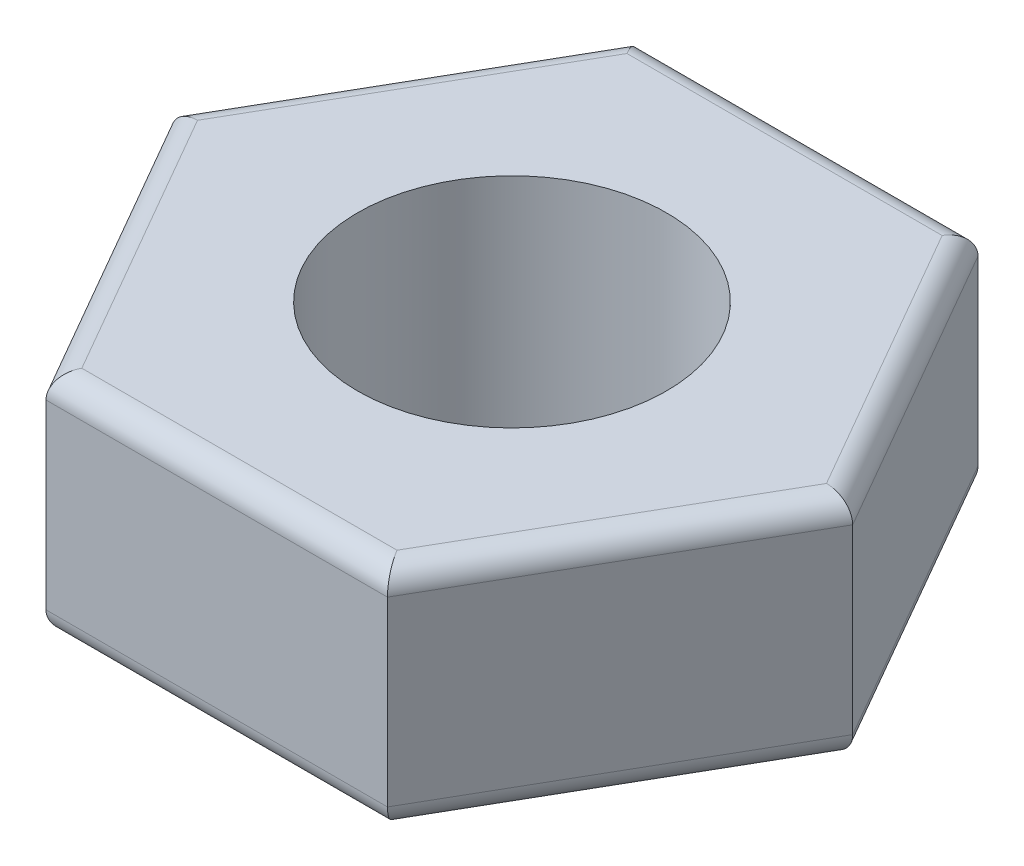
ISO-10303-21;
HEADER;
FILE_DESCRIPTION(('STEP AP214'),'2;1');
FILE_NAME('part.step','',(''),(''),'','','');
FILE_SCHEMA(('AUTOMOTIVE_DESIGN { 1 0 10303 214 1 1 1 1 }'));
ENDSEC;
DATA;
#1=APPLICATION_CONTEXT('core data for automotive mechanical design processes');
#2=APPLICATION_PROTOCOL_DEFINITION('international standard','automotive_design',2000,#1);
#3=PRODUCT_CONTEXT('',#1,'mechanical');
#4=PRODUCT('Part','Part','',(#3));
#5=PRODUCT_RELATED_PRODUCT_CATEGORY('part','',(#4));
#6=PRODUCT_DEFINITION_FORMATION('','',#4);
#7=PRODUCT_DEFINITION_CONTEXT('part definition',#1,'design');
#8=PRODUCT_DEFINITION('design','',#6,#7);
#9=PRODUCT_DEFINITION_SHAPE('','',#8);
#10=(LENGTH_UNIT() NAMED_UNIT(*) SI_UNIT(.MILLI.,.METRE.));
#11=(NAMED_UNIT(*) PLANE_ANGLE_UNIT() SI_UNIT($,.RADIAN.));
#12=(NAMED_UNIT(*) SI_UNIT($,.STERADIAN.) SOLID_ANGLE_UNIT());
#13=UNCERTAINTY_MEASURE_WITH_UNIT(LENGTH_MEASURE(1.E-05),#10,'distance_accuracy_value','');
#14=(GEOMETRIC_REPRESENTATION_CONTEXT(3) GLOBAL_UNCERTAINTY_ASSIGNED_CONTEXT((#13)) GLOBAL_UNIT_ASSIGNED_CONTEXT((#10,
#11,#12)) REPRESENTATION_CONTEXT('',''));
#15=CARTESIAN_POINT('',(0.,0.,0.));
#16=DIRECTION('',(0.,0.,1.));
#17=DIRECTION('',(1.,0.,0.));
#18=AXIS2_PLACEMENT_3D('',#15,#16,#17);
#19=CARTESIAN_POINT('',(3.75834261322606,5.,6.5));
#20=DIRECTION('',(0.,1.,0.));
#21=DIRECTION('',(0.,0.,1.));
#22=AXIS2_PLACEMENT_3D('',#19,#20,#21);
#23=PLANE('',#22);
#24=DIRECTION('',(-0.498887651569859,0.,0.866666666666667));
#25=VECTOR('',#24,1.);
#26=CARTESIAN_POINT('',(-7.06666666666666,5.,0.249443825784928));
#27=LINE('',#26,#25);
#28=CARTESIAN_POINT('',(-3.46923933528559,5.,-6.));
#29=VERTEX_POINT('',#28);
#30=CARTESIAN_POINT('',(-6.92307692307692,5.,0.));
#31=VERTEX_POINT('',#30);
#32=EDGE_CURVE('E38',#29,#31,#27,.T.);
#33=ORIENTED_EDGE('',*,*,#32,.T.);
#34=DIRECTION('',(0.498887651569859,0.,0.866666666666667));
#35=VECTOR('',#34,1.);
#36=CARTESIAN_POINT('',(-3.32500927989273,5.,6.25055617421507));
#37=LINE('',#36,#35);
#38=CARTESIAN_POINT('',(-3.46923933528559,5.,6.));
#39=VERTEX_POINT('',#38);
#40=EDGE_CURVE('E11',#31,#39,#37,.T.);
#41=ORIENTED_EDGE('',*,*,#40,.T.);
#42=DIRECTION('',(1.,0.,0.));
#43=VECTOR('',#42,1.);
#44=CARTESIAN_POINT('',(3.75834261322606,5.,6.));
#45=LINE('',#44,#43);
#46=CARTESIAN_POINT('',(3.46923933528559,5.,6.));
#47=VERTEX_POINT('',#46);
#48=EDGE_CURVE('E152',#39,#47,#45,.T.);
#49=ORIENTED_EDGE('',*,*,#48,.T.);
#50=DIRECTION('',(0.498887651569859,0.,-0.866666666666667));
#51=VECTOR('',#50,1.);
#52=CARTESIAN_POINT('',(7.06666666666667,5.,-0.249443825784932));
#53=LINE('',#52,#51);
#54=CARTESIAN_POINT('',(6.92307692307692,5.,0.));
#55=VERTEX_POINT('',#54);
#56=EDGE_CURVE('E230',#47,#55,#53,.T.);
#57=ORIENTED_EDGE('',*,*,#56,.T.);
#58=DIRECTION('',(-0.498887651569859,0.,-0.866666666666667));
#59=VECTOR('',#58,1.);
#60=CARTESIAN_POINT('',(3.32500927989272,5.,-6.25055617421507));
#61=LINE('',#60,#59);
#62=CARTESIAN_POINT('',(3.46923933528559,5.,-6.));
#63=VERTEX_POINT('',#62);
#64=EDGE_CURVE('E232',#55,#63,#61,.T.);
#65=ORIENTED_EDGE('',*,*,#64,.T.);
#66=DIRECTION('',(-1.,0.,0.));
#67=VECTOR('',#66,1.);
#68=CARTESIAN_POINT('',(-3.75834261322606,5.,-6.));
#69=LINE('',#68,#67);
#70=EDGE_CURVE('E48',#63,#29,#69,.T.);
#71=ORIENTED_EDGE('',*,*,#70,.T.);
#72=EDGE_LOOP('',(#33,#41,#49,#57,#65,#71));
#73=FACE_BOUND('',#72,.T.);
#74=CARTESIAN_POINT('',(0.,5.,0.));
#75=DIRECTION('',(0.,1.,0.));
#76=DIRECTION('',(0.,0.,1.));
#77=AXIS2_PLACEMENT_3D('',#74,#75,#76);
#78=CIRCLE('',#77,3.4);
#79=CARTESIAN_POINT('',(0.,5.,3.4));
#80=VERTEX_POINT('',#79);
#81=EDGE_CURVE('E141',#80,#80,#78,.T.);
#82=ORIENTED_EDGE('',*,*,#81,.F.);
#83=EDGE_LOOP('',(#82));
#84=FACE_BOUND('',#83,.T.);
#85=ADVANCED_FACE('F30',(#73,#84),#23,.T.);
#86=CARTESIAN_POINT('',(3.75834261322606,0.,6.5));
#87=DIRECTION('',(0.,1.,0.));
#88=DIRECTION('',(0.,0.,1.));
#89=AXIS2_PLACEMENT_3D('',#86,#87,#88);
#90=PLANE('',#89);
#91=DIRECTION('',(1.,0.,0.));
#92=VECTOR('',#91,1.);
#93=CARTESIAN_POINT('',(3.75834261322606,0.,6.));
#94=LINE('',#93,#92);
#95=CARTESIAN_POINT('',(3.46923933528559,0.,6.));
#96=VERTEX_POINT('',#95);
#97=CARTESIAN_POINT('',(-3.46923933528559,0.,6.));
#98=VERTEX_POINT('',#97);
#99=EDGE_CURVE('E200',#96,#98,#94,.F.);
#100=ORIENTED_EDGE('',*,*,#99,.T.);
#101=DIRECTION('',(0.498887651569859,0.,0.866666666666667));
#102=VECTOR('',#101,1.);
#103=CARTESIAN_POINT('',(-1.45418984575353,0.,9.50054008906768));
#104=LINE('',#103,#102);
#105=CARTESIAN_POINT('',(-6.92307692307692,0.,0.));
#106=VERTEX_POINT('',#105);
#107=EDGE_CURVE('E210',#98,#106,#104,.F.);
#108=ORIENTED_EDGE('',*,*,#107,.T.);
#109=DIRECTION('',(-0.498887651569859,0.,0.866666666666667));
#110=VECTOR('',#109,1.);
#111=CARTESIAN_POINT('',(-7.07499072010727,0.,0.263904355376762));
#112=LINE('',#111,#110);
#113=CARTESIAN_POINT('',(-3.46923933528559,0.,-6.));
#114=VERTEX_POINT('',#113);
#115=EDGE_CURVE('E208',#106,#114,#112,.F.);
#116=ORIENTED_EDGE('',*,*,#115,.T.);
#117=DIRECTION('',(-1.,0.,0.));
#118=VECTOR('',#117,1.);
#119=CARTESIAN_POINT('',(3.75834261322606,0.,-6.));
#120=LINE('',#119,#118);
#121=CARTESIAN_POINT('',(3.46923933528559,0.,-6.));
#122=VERTEX_POINT('',#121);
#123=EDGE_CURVE('E206',#114,#122,#120,.F.);
#124=ORIENTED_EDGE('',*,*,#123,.T.);
#125=DIRECTION('',(-0.498887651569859,0.,-0.866666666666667));
#126=VECTOR('',#125,1.);
#127=CARTESIAN_POINT('',(8.94581015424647,0.,3.51388827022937));
#128=LINE('',#127,#126);
#129=CARTESIAN_POINT('',(6.92307692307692,0.,0.));
#130=VERTEX_POINT('',#129);
#131=EDGE_CURVE('E204',#122,#130,#128,.F.);
#132=ORIENTED_EDGE('',*,*,#131,.T.);
#133=DIRECTION('',(0.498887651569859,0.,-0.866666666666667));
#134=VECTOR('',#133,1.);
#135=CARTESIAN_POINT('',(3.32500927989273,0.,6.25055617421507));
#136=LINE('',#135,#134);
#137=EDGE_CURVE('E202',#130,#96,#136,.F.);
#138=ORIENTED_EDGE('',*,*,#137,.T.);
#139=EDGE_LOOP('',(#100,#108,#116,#124,#132,#138));
#140=FACE_BOUND('',#139,.T.);
#141=CARTESIAN_POINT('',(0.,0.,0.));
#142=DIRECTION('',(0.,1.,0.));
#143=DIRECTION('',(0.,0.,1.));
#144=AXIS2_PLACEMENT_3D('',#141,#142,#143);
#145=CIRCLE('',#144,3.4);
#146=CARTESIAN_POINT('',(0.,0.,3.4));
#147=VERTEX_POINT('',#146);
#148=EDGE_CURVE('E183',#147,#147,#145,.T.);
#149=ORIENTED_EDGE('',*,*,#148,.T.);
#150=EDGE_LOOP('',(#149));
#151=FACE_BOUND('',#150,.T.);
#152=ADVANCED_FACE('F270',(#140,#151),#90,.F.);
#153=CARTESIAN_POINT('',(-3.75834261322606,5.,6.5));
#154=DIRECTION('',(0.,0.,-1.));
#155=DIRECTION('',(-1.,0.,0.));
#156=AXIS2_PLACEMENT_3D('',#153,#154,#155);
#157=PLANE('',#156);
#158=DIRECTION('',(0.,-1.,0.));
#159=VECTOR('',#158,1.);
#160=CARTESIAN_POINT('',(-3.75834261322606,5.,6.5));
#161=LINE('',#160,#159);
#162=CARTESIAN_POINT('',(-3.75834261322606,4.5,6.5));
#163=VERTEX_POINT('',#162);
#164=CARTESIAN_POINT('',(-3.75834261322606,0.5,6.5));
#165=VERTEX_POINT('',#164);
#166=EDGE_CURVE('E120',#163,#165,#161,.T.);
#167=ORIENTED_EDGE('',*,*,#166,.T.);
#168=DIRECTION('',(1.,0.,0.));
#169=VECTOR('',#168,1.);
#170=CARTESIAN_POINT('',(-3.75834261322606,0.5,6.5));
#171=LINE('',#170,#169);
#172=CARTESIAN_POINT('',(3.75834261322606,0.5,6.5));
#173=VERTEX_POINT('',#172);
#174=EDGE_CURVE('E127',#165,#173,#171,.T.);
#175=ORIENTED_EDGE('',*,*,#174,.T.);
#176=DIRECTION('',(0.,-1.,0.));
#177=VECTOR('',#176,1.);
#178=CARTESIAN_POINT('',(3.75834261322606,5.,6.5));
#179=LINE('',#178,#177);
#180=CARTESIAN_POINT('',(3.75834261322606,4.5,6.5));
#181=VERTEX_POINT('',#180);
#182=EDGE_CURVE('E122',#181,#173,#179,.T.);
#183=ORIENTED_EDGE('',*,*,#182,.F.);
#184=DIRECTION('',(1.,0.,0.));
#185=VECTOR('',#184,1.);
#186=CARTESIAN_POINT('',(-3.75834261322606,4.5,6.5));
#187=LINE('',#186,#185);
#188=EDGE_CURVE('E118',#181,#163,#187,.F.);
#189=ORIENTED_EDGE('',*,*,#188,.T.);
#190=EDGE_LOOP('',(#167,#175,#183,#189));
#191=FACE_BOUND('',#190,.T.);
#192=ADVANCED_FACE('F32',(#191),#157,.F.);
#193=CARTESIAN_POINT('',(3.75834261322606,5.,6.5));
#194=DIRECTION('',(-0.866666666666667,0.,-0.498887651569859));
#195=DIRECTION('',(-0.498887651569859,0.,0.866666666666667));
#196=AXIS2_PLACEMENT_3D('',#193,#194,#195);
#197=PLANE('',#196);
#198=ORIENTED_EDGE('',*,*,#182,.T.);
#199=DIRECTION('',(0.498887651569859,0.,-0.866666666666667));
#200=VECTOR('',#199,1.);
#201=CARTESIAN_POINT('',(3.75834261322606,0.5,6.5));
#202=LINE('',#201,#200);
#203=CARTESIAN_POINT('',(7.5,0.5,0.));
#204=VERTEX_POINT('',#203);
#205=EDGE_CURVE('E128',#173,#204,#202,.T.);
#206=ORIENTED_EDGE('',*,*,#205,.T.);
#207=DIRECTION('',(0.,-1.,0.));
#208=VECTOR('',#207,1.);
#209=CARTESIAN_POINT('',(7.5,5.,0.));
#210=LINE('',#209,#208);
#211=CARTESIAN_POINT('',(7.5,4.5,0.));
#212=VERTEX_POINT('',#211);
#213=EDGE_CURVE('E195',#212,#204,#210,.T.);
#214=ORIENTED_EDGE('',*,*,#213,.F.);
#215=DIRECTION('',(0.498887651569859,0.,-0.866666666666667));
#216=VECTOR('',#215,1.);
#217=CARTESIAN_POINT('',(3.75834261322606,4.5,6.5));
#218=LINE('',#217,#216);
#219=EDGE_CURVE('E225',#212,#181,#218,.F.);
#220=ORIENTED_EDGE('',*,*,#219,.T.);
#221=EDGE_LOOP('',(#198,#206,#214,#220));
#222=FACE_BOUND('',#221,.T.);
#223=ADVANCED_FACE('F252',(#222),#197,.F.);
#224=CARTESIAN_POINT('',(3.75834261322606,5.,-6.5));
#225=DIRECTION('',(-0.866666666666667,0.,0.498887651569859));
#226=DIRECTION('',(0.498887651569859,0.,0.866666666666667));
#227=AXIS2_PLACEMENT_3D('',#224,#225,#226);
#228=PLANE('',#227);
#229=ORIENTED_EDGE('',*,*,#213,.T.);
#230=DIRECTION('',(-0.498887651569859,0.,-0.866666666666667));
#231=VECTOR('',#230,1.);
#232=CARTESIAN_POINT('',(3.75834261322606,0.5,-6.5));
#233=LINE('',#232,#231);
#234=CARTESIAN_POINT('',(3.75834261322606,0.5,-6.5));
#235=VERTEX_POINT('',#234);
#236=EDGE_CURVE('E223',#204,#235,#233,.T.);
#237=ORIENTED_EDGE('',*,*,#236,.T.);
#238=DIRECTION('',(0.,-1.,0.));
#239=VECTOR('',#238,1.);
#240=CARTESIAN_POINT('',(3.75834261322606,5.,-6.5));
#241=LINE('',#240,#239);
#242=CARTESIAN_POINT('',(3.75834261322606,4.5,-6.5));
#243=VERTEX_POINT('',#242);
#244=EDGE_CURVE('E192',#243,#235,#241,.T.);
#245=ORIENTED_EDGE('',*,*,#244,.F.);
#246=DIRECTION('',(-0.498887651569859,0.,-0.866666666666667));
#247=VECTOR('',#246,1.);
#248=CARTESIAN_POINT('',(7.5,4.5,0.));
#249=LINE('',#248,#247);
#250=EDGE_CURVE('E221',#243,#212,#249,.F.);
#251=ORIENTED_EDGE('',*,*,#250,.T.);
#252=EDGE_LOOP('',(#229,#237,#245,#251));
#253=FACE_BOUND('',#252,.T.);
#254=ADVANCED_FACE('F256',(#253),#228,.F.);
#255=CARTESIAN_POINT('',(-3.75834261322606,5.,-6.5));
#256=DIRECTION('',(0.,0.,1.));
#257=DIRECTION('',(1.,0.,0.));
#258=AXIS2_PLACEMENT_3D('',#255,#256,#257);
#259=PLANE('',#258);
#260=ORIENTED_EDGE('',*,*,#244,.T.);
#261=DIRECTION('',(-1.,0.,0.));
#262=VECTOR('',#261,1.);
#263=CARTESIAN_POINT('',(-3.75834261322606,0.5,-6.5));
#264=LINE('',#263,#262);
#265=CARTESIAN_POINT('',(-3.75834261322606,0.5,-6.5));
#266=VERTEX_POINT('',#265);
#267=EDGE_CURVE('E219',#235,#266,#264,.T.);
#268=ORIENTED_EDGE('',*,*,#267,.T.);
#269=DIRECTION('',(0.,-1.,0.));
#270=VECTOR('',#269,1.);
#271=CARTESIAN_POINT('',(-3.75834261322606,5.,-6.5));
#272=LINE('',#271,#270);
#273=CARTESIAN_POINT('',(-3.75834261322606,4.5,-6.5));
#274=VERTEX_POINT('',#273);
#275=EDGE_CURVE('E189',#274,#266,#272,.T.);
#276=ORIENTED_EDGE('',*,*,#275,.F.);
#277=DIRECTION('',(-1.,0.,0.));
#278=VECTOR('',#277,1.);
#279=CARTESIAN_POINT('',(3.75834261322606,4.5,-6.5));
#280=LINE('',#279,#278);
#281=EDGE_CURVE('E217',#274,#243,#280,.F.);
#282=ORIENTED_EDGE('',*,*,#281,.T.);
#283=EDGE_LOOP('',(#260,#268,#276,#282));
#284=FACE_BOUND('',#283,.T.);
#285=ADVANCED_FACE('F280',(#284),#259,.F.);
#286=CARTESIAN_POINT('',(-3.75834261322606,5.,-6.5));
#287=DIRECTION('',(0.866666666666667,0.,0.498887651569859));
#288=DIRECTION('',(0.498887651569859,0.,-0.866666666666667));
#289=AXIS2_PLACEMENT_3D('',#286,#287,#288);
#290=PLANE('',#289);
#291=ORIENTED_EDGE('',*,*,#275,.T.);
#292=DIRECTION('',(-0.498887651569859,0.,0.866666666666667));
#293=VECTOR('',#292,1.);
#294=CARTESIAN_POINT('',(-3.75834261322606,0.5,-6.5));
#295=LINE('',#294,#293);
#296=CARTESIAN_POINT('',(-7.5,0.5,0.));
#297=VERTEX_POINT('',#296);
#298=EDGE_CURVE('E215',#266,#297,#295,.T.);
#299=ORIENTED_EDGE('',*,*,#298,.T.);
#300=DIRECTION('',(0.,-1.,0.));
#301=VECTOR('',#300,1.);
#302=CARTESIAN_POINT('',(-7.5,5.,0.));
#303=LINE('',#302,#301);
#304=CARTESIAN_POINT('',(-7.5,4.5,0.));
#305=VERTEX_POINT('',#304);
#306=EDGE_CURVE('E140',#305,#297,#303,.T.);
#307=ORIENTED_EDGE('',*,*,#306,.F.);
#308=DIRECTION('',(-0.498887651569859,0.,0.866666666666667));
#309=VECTOR('',#308,1.);
#310=CARTESIAN_POINT('',(-3.75834261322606,4.5,-6.5));
#311=LINE('',#310,#309);
#312=EDGE_CURVE('E213',#305,#274,#311,.F.);
#313=ORIENTED_EDGE('',*,*,#312,.T.);
#314=EDGE_LOOP('',(#291,#299,#307,#313));
#315=FACE_BOUND('',#314,.T.);
#316=ADVANCED_FACE('F282',(#315),#290,.F.);
#317=CARTESIAN_POINT('',(-3.75834261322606,5.,6.5));
#318=DIRECTION('',(0.866666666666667,0.,-0.498887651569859));
#319=DIRECTION('',(-0.498887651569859,0.,-0.866666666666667));
#320=AXIS2_PLACEMENT_3D('',#317,#318,#319);
#321=PLANE('',#320);
#322=ORIENTED_EDGE('',*,*,#306,.T.);
#323=DIRECTION('',(0.498887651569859,0.,0.866666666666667));
#324=VECTOR('',#323,1.);
#325=CARTESIAN_POINT('',(-3.75834261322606,0.5,6.5));
#326=LINE('',#325,#324);
#327=EDGE_CURVE('E139',#297,#165,#326,.T.);
#328=ORIENTED_EDGE('',*,*,#327,.T.);
#329=ORIENTED_EDGE('',*,*,#166,.F.);
#330=DIRECTION('',(0.498887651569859,0.,0.866666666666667));
#331=VECTOR('',#330,1.);
#332=CARTESIAN_POINT('',(-7.5,4.5,0.));
#333=LINE('',#332,#331);
#334=EDGE_CURVE('E136',#163,#305,#333,.F.);
#335=ORIENTED_EDGE('',*,*,#334,.T.);
#336=EDGE_LOOP('',(#322,#328,#329,#335));
#337=FACE_BOUND('',#336,.T.);
#338=ADVANCED_FACE('F135',(#337),#321,.F.);
#339=CARTESIAN_POINT('',(0.,5.,0.));
#340=DIRECTION('',(0.,-1.,0.));
#341=DIRECTION('',(0.,0.,-1.));
#342=AXIS2_PLACEMENT_3D('',#339,#340,#341);
#343=CYLINDRICAL_SURFACE('',#342,3.4);
#344=ORIENTED_EDGE('',*,*,#81,.T.);
#345=EDGE_LOOP('',(#344));
#346=FACE_BOUND('',#345,.T.);
#347=ORIENTED_EDGE('',*,*,#148,.F.);
#348=EDGE_LOOP('',(#347));
#349=FACE_BOUND('',#348,.T.);
#350=ADVANCED_FACE('F311',(#346,#349),#343,.F.);
#351=CARTESIAN_POINT('',(3.32500927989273,0.5,-6.25055617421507));
#352=DIRECTION('',(-0.498887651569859,0.,-0.866666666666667));
#353=DIRECTION('',(-0.866666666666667,0.,0.498887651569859));
#354=AXIS2_PLACEMENT_3D('',#351,#352,#353);
#355=CYLINDRICAL_SURFACE('',#354,0.5);
#356=CARTESIAN_POINT('',(6.92307692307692,0.5,0.));
#357=DIRECTION('',(0.,0.,-1.));
#358=DIRECTION('',(1.,0.,0.));
#359=AXIS2_PLACEMENT_3D('',#356,#357,#358);
#360=ELLIPSE('',#359,0.576923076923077,0.5);
#361=EDGE_CURVE('E177',#130,#204,#360,.F.);
#362=ORIENTED_EDGE('',*,*,#361,.F.);
#363=ORIENTED_EDGE('',*,*,#131,.F.);
#364=CARTESIAN_POINT('',(3.46923933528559,0.5,-6.));
#365=DIRECTION('',(-0.865704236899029,0.,-0.500555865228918));
#366=DIRECTION('',(0.500555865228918,0.,-0.865704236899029));
#367=AXIS2_PLACEMENT_3D('',#364,#365,#366);
#368=ELLIPSE('',#367,0.577564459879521,0.5);
#369=EDGE_CURVE('E180',#235,#122,#368,.T.);
#370=ORIENTED_EDGE('',*,*,#369,.F.);
#371=ORIENTED_EDGE('',*,*,#236,.F.);
#372=EDGE_LOOP('',(#362,#363,#370,#371));
#373=FACE_BOUND('',#372,.T.);
#374=ADVANCED_FACE('F261',(#373),#355,.T.);
#375=CARTESIAN_POINT('',(-3.75834261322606,0.5,-6.));
#376=DIRECTION('',(-1.,0.,0.));
#377=DIRECTION('',(0.,0.,1.));
#378=AXIS2_PLACEMENT_3D('',#375,#376,#377);
#379=CYLINDRICAL_SURFACE('',#378,0.5);
#380=ORIENTED_EDGE('',*,*,#369,.T.);
#381=ORIENTED_EDGE('',*,*,#123,.F.);
#382=CARTESIAN_POINT('',(-3.46923933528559,0.5,-6.));
#383=DIRECTION('',(-0.865704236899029,0.,0.500555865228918));
#384=DIRECTION('',(-0.500555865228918,0.,-0.865704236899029));
#385=AXIS2_PLACEMENT_3D('',#382,#383,#384);
#386=ELLIPSE('',#385,0.577564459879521,0.5);
#387=EDGE_CURVE('E174',#266,#114,#386,.T.);
#388=ORIENTED_EDGE('',*,*,#387,.F.);
#389=ORIENTED_EDGE('',*,*,#267,.F.);
#390=EDGE_LOOP('',(#380,#381,#388,#389));
#391=FACE_BOUND('',#390,.T.);
#392=ADVANCED_FACE('F275',(#391),#379,.T.);
#393=CARTESIAN_POINT('',(3.32500927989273,0.5,6.25055617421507));
#394=DIRECTION('',(0.498887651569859,0.,-0.866666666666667));
#395=DIRECTION('',(-0.866666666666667,0.,-0.498887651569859));
#396=AXIS2_PLACEMENT_3D('',#393,#394,#395);
#397=CYLINDRICAL_SURFACE('',#396,0.5);
#398=ORIENTED_EDGE('',*,*,#361,.T.);
#399=ORIENTED_EDGE('',*,*,#205,.F.);
#400=CARTESIAN_POINT('',(3.46923933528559,0.5,6.));
#401=DIRECTION('',(0.865704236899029,0.,-0.500555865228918));
#402=DIRECTION('',(0.500555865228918,0.,0.865704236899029));
#403=AXIS2_PLACEMENT_3D('',#400,#401,#402);
#404=ELLIPSE('',#403,0.577564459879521,0.5);
#405=EDGE_CURVE('E171',#96,#173,#404,.F.);
#406=ORIENTED_EDGE('',*,*,#405,.F.);
#407=ORIENTED_EDGE('',*,*,#137,.F.);
#408=EDGE_LOOP('',(#398,#399,#406,#407));
#409=FACE_BOUND('',#408,.T.);
#410=ADVANCED_FACE('F266',(#409),#397,.T.);
#411=CARTESIAN_POINT('',(-3.32500927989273,0.5,-6.25055617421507));
#412=DIRECTION('',(-0.498887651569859,0.,0.866666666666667));
#413=DIRECTION('',(0.866666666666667,0.,0.498887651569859));
#414=AXIS2_PLACEMENT_3D('',#411,#412,#413);
#415=CYLINDRICAL_SURFACE('',#414,0.5);
#416=ORIENTED_EDGE('',*,*,#387,.T.);
#417=ORIENTED_EDGE('',*,*,#115,.F.);
#418=CARTESIAN_POINT('',(-6.92307692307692,0.5,0.));
#419=DIRECTION('',(0.,0.,1.));
#420=DIRECTION('',(-1.,0.,0.));
#421=AXIS2_PLACEMENT_3D('',#418,#419,#420);
#422=ELLIPSE('',#421,0.576923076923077,0.5);
#423=EDGE_CURVE('E169',#297,#106,#422,.T.);
#424=ORIENTED_EDGE('',*,*,#423,.F.);
#425=ORIENTED_EDGE('',*,*,#298,.F.);
#426=EDGE_LOOP('',(#416,#417,#424,#425));
#427=FACE_BOUND('',#426,.T.);
#428=ADVANCED_FACE('F286',(#427),#415,.T.);
#429=CARTESIAN_POINT('',(-3.75834261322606,0.5,6.));
#430=DIRECTION('',(1.,0.,0.));
#431=DIRECTION('',(0.,0.,-1.));
#432=AXIS2_PLACEMENT_3D('',#429,#430,#431);
#433=CYLINDRICAL_SURFACE('',#432,0.5);
#434=ORIENTED_EDGE('',*,*,#405,.T.);
#435=ORIENTED_EDGE('',*,*,#174,.F.);
#436=CARTESIAN_POINT('',(-3.46923933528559,0.5,6.));
#437=DIRECTION('',(0.865704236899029,0.,0.500555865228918));
#438=DIRECTION('',(0.500555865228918,0.,-0.865704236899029));
#439=AXIS2_PLACEMENT_3D('',#436,#437,#438);
#440=ELLIPSE('',#439,0.577564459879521,0.5);
#441=EDGE_CURVE('E167',#98,#165,#440,.F.);
#442=ORIENTED_EDGE('',*,*,#441,.F.);
#443=ORIENTED_EDGE('',*,*,#99,.F.);
#444=EDGE_LOOP('',(#434,#435,#442,#443));
#445=FACE_BOUND('',#444,.T.);
#446=ADVANCED_FACE('F292',(#445),#433,.T.);
#447=CARTESIAN_POINT('',(-3.32500927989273,0.5,6.25055617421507));
#448=DIRECTION('',(0.498887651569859,0.,0.866666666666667));
#449=DIRECTION('',(0.866666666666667,0.,-0.498887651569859));
#450=AXIS2_PLACEMENT_3D('',#447,#448,#449);
#451=CYLINDRICAL_SURFACE('',#450,0.5);
#452=ORIENTED_EDGE('',*,*,#423,.T.);
#453=ORIENTED_EDGE('',*,*,#107,.F.);
#454=ORIENTED_EDGE('',*,*,#441,.T.);
#455=ORIENTED_EDGE('',*,*,#327,.F.);
#456=EDGE_LOOP('',(#452,#453,#454,#455));
#457=FACE_BOUND('',#456,.T.);
#458=ADVANCED_FACE('F288',(#457),#451,.T.);
#459=CARTESIAN_POINT('',(8.94581015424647,4.5,3.51388827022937));
#460=DIRECTION('',(0.498887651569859,0.,0.866666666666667));
#461=DIRECTION('',(0.866666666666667,0.,-0.498887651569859));
#462=AXIS2_PLACEMENT_3D('',#459,#460,#461);
#463=CYLINDRICAL_SURFACE('',#462,0.5);
#464=CARTESIAN_POINT('',(6.92307692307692,4.5,0.));
#465=DIRECTION('',(0.,0.,1.));
#466=DIRECTION('',(-1.,0.,0.));
#467=AXIS2_PLACEMENT_3D('',#464,#465,#466);
#468=ELLIPSE('',#467,0.576923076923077,0.5);
#469=EDGE_CURVE('E161',#212,#55,#468,.T.);
#470=ORIENTED_EDGE('',*,*,#469,.F.);
#471=ORIENTED_EDGE('',*,*,#250,.F.);
#472=CARTESIAN_POINT('',(3.46923933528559,4.5,-6.));
#473=DIRECTION('',(0.865704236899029,0.,0.500555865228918));
#474=DIRECTION('',(-0.500555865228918,0.,0.865704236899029));
#475=AXIS2_PLACEMENT_3D('',#472,#473,#474);
#476=ELLIPSE('',#475,0.577564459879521,0.5);
#477=EDGE_CURVE('E164',#63,#243,#476,.F.);
#478=ORIENTED_EDGE('',*,*,#477,.F.);
#479=ORIENTED_EDGE('',*,*,#64,.F.);
#480=EDGE_LOOP('',(#470,#471,#478,#479));
#481=FACE_BOUND('',#480,.T.);
#482=ADVANCED_FACE('F241',(#481),#463,.T.);
#483=CARTESIAN_POINT('',(3.75834261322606,4.5,-6.));
#484=DIRECTION('',(1.,0.,0.));
#485=DIRECTION('',(0.,0.,-1.));
#486=AXIS2_PLACEMENT_3D('',#483,#484,#485);
#487=CYLINDRICAL_SURFACE('',#486,0.5);
#488=ORIENTED_EDGE('',*,*,#477,.T.);
#489=ORIENTED_EDGE('',*,*,#281,.F.);
#490=CARTESIAN_POINT('',(-3.46923933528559,4.5,-6.));
#491=DIRECTION('',(0.865704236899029,0.,-0.500555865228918));
#492=DIRECTION('',(0.500555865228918,0.,0.865704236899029));
#493=AXIS2_PLACEMENT_3D('',#490,#491,#492);
#494=ELLIPSE('',#493,0.577564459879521,0.5);
#495=EDGE_CURVE('E158',#29,#274,#494,.F.);
#496=ORIENTED_EDGE('',*,*,#495,.F.);
#497=ORIENTED_EDGE('',*,*,#70,.F.);
#498=EDGE_LOOP('',(#488,#489,#496,#497));
#499=FACE_BOUND('',#498,.T.);
#500=ADVANCED_FACE('F244',(#499),#487,.T.);
#501=CARTESIAN_POINT('',(3.32500927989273,4.5,6.25055617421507));
#502=DIRECTION('',(-0.498887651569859,0.,0.866666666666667));
#503=DIRECTION('',(0.866666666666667,0.,0.498887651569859));
#504=AXIS2_PLACEMENT_3D('',#501,#502,#503);
#505=CYLINDRICAL_SURFACE('',#504,0.5);
#506=ORIENTED_EDGE('',*,*,#469,.T.);
#507=ORIENTED_EDGE('',*,*,#56,.F.);
#508=CARTESIAN_POINT('',(3.46923933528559,4.5,6.));
#509=DIRECTION('',(-0.865704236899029,0.,0.500555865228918));
#510=DIRECTION('',(-0.500555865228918,0.,-0.865704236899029));
#511=AXIS2_PLACEMENT_3D('',#508,#509,#510);
#512=ELLIPSE('',#511,0.577564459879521,0.5);
#513=EDGE_CURVE('E154',#181,#47,#512,.T.);
#514=ORIENTED_EDGE('',*,*,#513,.F.);
#515=ORIENTED_EDGE('',*,*,#219,.F.);
#516=EDGE_LOOP('',(#506,#507,#514,#515));
#517=FACE_BOUND('',#516,.T.);
#518=ADVANCED_FACE('F248',(#517),#505,.T.);
#519=CARTESIAN_POINT('',(-7.07499072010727,4.5,0.263904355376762));
#520=DIRECTION('',(0.498887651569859,0.,-0.866666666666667));
#521=DIRECTION('',(-0.866666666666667,0.,-0.498887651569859));
#522=AXIS2_PLACEMENT_3D('',#519,#520,#521);
#523=CYLINDRICAL_SURFACE('',#522,0.5);
#524=ORIENTED_EDGE('',*,*,#495,.T.);
#525=ORIENTED_EDGE('',*,*,#312,.F.);
#526=CARTESIAN_POINT('',(-6.92307692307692,4.5,0.));
#527=DIRECTION('',(0.,0.,-1.));
#528=DIRECTION('',(1.,0.,0.));
#529=AXIS2_PLACEMENT_3D('',#526,#527,#528);
#530=ELLIPSE('',#529,0.576923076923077,0.5);
#531=EDGE_CURVE('E148',#31,#305,#530,.F.);
#532=ORIENTED_EDGE('',*,*,#531,.F.);
#533=ORIENTED_EDGE('',*,*,#32,.F.);
#534=EDGE_LOOP('',(#524,#525,#532,#533));
#535=FACE_BOUND('',#534,.T.);
#536=ADVANCED_FACE('F246',(#535),#523,.T.);
#537=CARTESIAN_POINT('',(3.75834261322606,4.5,6.));
#538=DIRECTION('',(-1.,0.,0.));
#539=DIRECTION('',(0.,0.,1.));
#540=AXIS2_PLACEMENT_3D('',#537,#538,#539);
#541=CYLINDRICAL_SURFACE('',#540,0.5);
#542=ORIENTED_EDGE('',*,*,#513,.T.);
#543=ORIENTED_EDGE('',*,*,#48,.F.);
#544=CARTESIAN_POINT('',(-3.46923933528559,4.5,6.));
#545=DIRECTION('',(-0.865704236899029,0.,-0.500555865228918));
#546=DIRECTION('',(-0.500555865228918,0.,0.865704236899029));
#547=AXIS2_PLACEMENT_3D('',#544,#545,#546);
#548=ELLIPSE('',#547,0.577564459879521,0.5);
#549=EDGE_CURVE('E146',#163,#39,#548,.T.);
#550=ORIENTED_EDGE('',*,*,#549,.F.);
#551=ORIENTED_EDGE('',*,*,#188,.F.);
#552=EDGE_LOOP('',(#542,#543,#550,#551));
#553=FACE_BOUND('',#552,.T.);
#554=ADVANCED_FACE('F151',(#553),#541,.T.);
#555=CARTESIAN_POINT('',(-1.45418984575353,4.5,9.50054008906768));
#556=DIRECTION('',(-0.498887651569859,0.,-0.866666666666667));
#557=DIRECTION('',(-0.866666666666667,0.,0.498887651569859));
#558=AXIS2_PLACEMENT_3D('',#555,#556,#557);
#559=CYLINDRICAL_SURFACE('',#558,0.5);
#560=ORIENTED_EDGE('',*,*,#531,.T.);
#561=ORIENTED_EDGE('',*,*,#334,.F.);
#562=ORIENTED_EDGE('',*,*,#549,.T.);
#563=ORIENTED_EDGE('',*,*,#40,.F.);
#564=EDGE_LOOP('',(#560,#561,#562,#563));
#565=FACE_BOUND('',#564,.T.);
#566=ADVANCED_FACE('F144',(#565),#559,.T.);
#567=CLOSED_SHELL('',(#85,#152,#192,#223,#254,#285,#316,#338,#350,#374,#392,#410,#428,#446,#458,
#482,#500,#518,#536,#554,#566));
#568=MANIFOLD_SOLID_BREP('B2',#567);
#569=ADVANCED_BREP_SHAPE_REPRESENTATION('',(#18,#568),#14);
#570=SHAPE_DEFINITION_REPRESENTATION(#9,#569);
ENDSEC;
END-ISO-10303-21;
